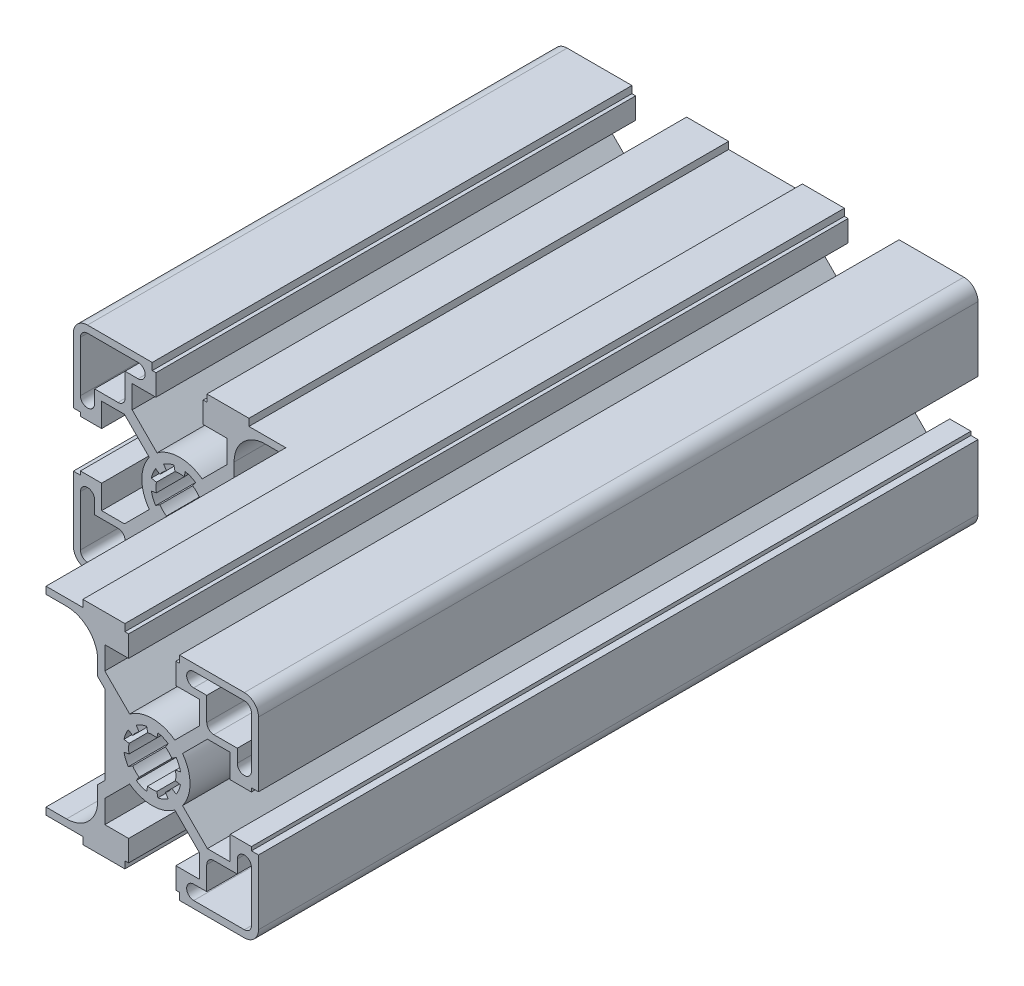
from build123d import *

# Parameters (mm, degrees)
BOSS_EXTRUDE1_DEPTH = 76.2
SKETCH2_W           = 45.0088
SKETCH2_H           = 45.0088
CUT_EXTRUDE1_DEPTH  = 50.8


with BuildPart() as part:
    # Sketch1 → Boss-Extrude1 (new, symmetric)
    with BuildSketch(Plane.XY):
        with BuildLine():
            Line((-42.0116, 22.5044), (-28.2956, 22.5044))
            Line((-28.2956, 22.5044), (-28.2956, 21.0058))
            Line((-28.2956, 21.0058), (-27.5082, 21.0058))
            Line((-27.5082, 21.0058), (-27.5082, 16.51))
            Line((-27.5082, 16.51), (-32.5501, 16.51))
            Line((-32.5501, 16.51), (-32.5501, 11.680106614))
            Line((-32.5501, 11.680106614), (-27.285426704, 6.415433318))
            ThreePointArc((-27.285426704, 6.415433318), (-22.5044, 8.001), (-17.723373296, 6.415433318))
            Line((-17.723373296, 6.415433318), (-12.4587, 11.680106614))
            Line((-12.4587, 11.680106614), (-12.4587, 16.51))
            Line((-12.4587, 16.51), (-17.5006, 16.51))
            Line((-17.5006, 16.51), (-17.5006, 21.0058))
            Line((-17.5006, 21.0058), (-16.7132, 21.0058))
            Line((-16.7132, 21.0058), (-16.7132, 22.5044))
            Line((-16.7132, 22.5044), (-7.8105, 22.5044))
            Line((-7.8105, 22.5044), (-7.8105, 21.0058))
            Line((-7.8105, 21.0058), (7.8105, 21.0058))
            Line((7.8105, 21.0058), (7.8105, 22.5044))
            Line((7.8105, 22.5044), (16.7132, 22.5044))
            Line((16.7132, 22.5044), (16.7132, 21.0058))
            Line((16.7132, 21.0058), (17.5006, 21.0058))
            Line((17.5006, 21.0058), (17.5006, 16.51))
            Line((17.5006, 16.51), (12.4587, 16.51))
            Line((12.4587, 16.51), (12.4587, 11.680106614))
            Line((12.4587, 11.680106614), (17.723373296, 6.415433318))
            ThreePointArc((17.723373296, 6.415433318), (22.5044, 8.001), (27.285426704, 6.415433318))
            Line((27.285426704, 6.415433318), (32.5501, 11.680106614))
            Line((32.5501, 11.680106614), (32.5501, 16.51))
            Line((32.5501, 16.51), (27.5082, 16.51))
            Line((27.5082, 16.51), (27.5082, 21.0058))
            Line((27.5082, 21.0058), (28.2956, 21.0058))
            Line((28.2956, 21.0058), (28.2956, 22.5044))
            Line((28.2956, 22.5044), (42.0116, 22.5044))
            ThreePointArc((42.0116, 22.5044), (44.130940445, 21.626540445), (45.0088, 19.5072))
            Line((45.0088, 19.5072), (45.0088, 5.7912))
            Line((45.0088, 5.7912), (43.5102, 5.7912))
            Line((43.5102, 5.7912), (43.5102, 5.0038))
            Line((43.5102, 5.0038), (39.0144, 5.0038))
            Line((39.0144, 5.0038), (39.0144, 10.0457))
            Line((39.0144, 10.0457), (34.184506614, 10.0457))
            Line((34.184506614, 10.0457), (28.919833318, 4.781026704))
            ThreePointArc((28.919833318, 4.781026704), (30.5054, 0), (28.919833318, -4.781026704))
            Line((28.919833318, -4.781026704), (34.184506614, -10.0457))
            Line((34.184506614, -10.0457), (39.0144, -10.0457))
            Line((39.0144, -10.0457), (39.0144, -5.0038))
            Line((39.0144, -5.0038), (43.5102, -5.0038))
            Line((43.5102, -5.0038), (43.5102, -5.7912))
            Line((43.5102, -5.7912), (45.0088, -5.7912))
            Line((45.0088, -5.7912), (45.0088, -19.5072))
            ThreePointArc((45.0088, -19.5072), (44.130940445, -21.626540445), (42.0116, -22.5044))
            Line((42.0116, -22.5044), (28.2956, -22.5044))
            Line((28.2956, -22.5044), (28.2956, -21.0058))
            Line((28.2956, -21.0058), (27.5082, -21.0058))
            Line((27.5082, -21.0058), (27.5082, -16.51))
            Line((27.5082, -16.51), (32.5501, -16.51))
            Line((32.5501, -16.51), (32.5501, -11.680106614))
            Line((32.5501, -11.680106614), (27.285426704, -6.415433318))
            ThreePointArc((27.285426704, -6.415433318), (22.5044, -8.001), (17.723373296, -6.415433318))
            Line((17.723373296, -6.415433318), (12.4587, -11.680106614))
            Line((12.4587, -11.680106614), (12.4587, -16.51))
            Line((12.4587, -16.51), (17.5006, -16.51))
            Line((17.5006, -16.51), (17.5006, -21.0058))
            Line((17.5006, -21.0058), (16.7132, -21.0058))
            Line((16.7132, -21.0058), (16.7132, -22.5044))
            Line((16.7132, -22.5044), (7.8105, -22.5044))
            Line((7.8105, -22.5044), (7.8105, -21.0058))
            Line((7.8105, -21.0058), (-7.8105, -21.0058))
            Line((-7.8105, -21.0058), (-7.8105, -22.5044))
            Line((-7.8105, -22.5044), (-16.7132, -22.5044))
            Line((-16.7132, -22.5044), (-16.7132, -21.0058))
            Line((-16.7132, -21.0058), (-17.5006, -21.0058))
            Line((-17.5006, -21.0058), (-17.5006, -16.51))
            Line((-17.5006, -16.51), (-12.4587, -16.51))
            Line((-12.4587, -16.51), (-12.4587, -11.680106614))
            Line((-12.4587, -11.680106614), (-17.723373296, -6.415433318))
            ThreePointArc((-17.723373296, -6.415433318), (-22.5044, -8.001), (-27.285426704, -6.415433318))
            Line((-27.285426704, -6.415433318), (-32.5501, -11.680106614))
            Line((-32.5501, -11.680106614), (-32.5501, -16.51))
            Line((-32.5501, -16.51), (-27.5082, -16.51))
            Line((-27.5082, -16.51), (-27.5082, -21.0058))
            Line((-27.5082, -21.0058), (-28.2956, -21.0058))
            Line((-28.2956, -21.0058), (-28.2956, -22.5044))
            Line((-28.2956, -22.5044), (-42.0116, -22.5044))
            ThreePointArc((-42.0116, -22.5044), (-44.130940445, -21.626540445), (-45.0088, -19.5072))
            Line((-45.0088, -19.5072), (-45.0088, -5.7912))
            Line((-45.0088, -5.7912), (-43.5102, -5.7912))
            Line((-43.5102, -5.7912), (-43.5102, -5.0038))
            Line((-43.5102, -5.0038), (-39.0144, -5.0038))
            Line((-39.0144, -5.0038), (-39.0144, -10.0457))
            Line((-39.0144, -10.0457), (-34.184506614, -10.0457))
            Line((-34.184506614, -10.0457), (-28.919833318, -4.781026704))
            ThreePointArc((-28.919833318, -4.781026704), (-30.5054, 0), (-28.919833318, 4.781026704))
            Line((-28.919833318, 4.781026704), (-34.184506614, 10.0457))
            Line((-34.184506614, 10.0457), (-39.0144, 10.0457))
            Line((-39.0144, 10.0457), (-39.0144, 5.0038))
            Line((-39.0144, 5.0038), (-43.5102, 5.0038))
            Line((-43.5102, 5.0038), (-43.5102, 5.7912))
            Line((-43.5102, 5.7912), (-45.0088, 5.7912))
            Line((-45.0088, 5.7912), (-45.0088, 19.5072))
            ThreePointArc((-45.0088, 19.5072), (-44.130940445, 21.626540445), (-42.0116, 22.5044))
        make_face()
        with BuildLine():
            Line((-40.513, 11.5443), (-35.5473, 11.5443))
            ThreePointArc((-35.5473, 11.5443), (-34.487629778, 11.983229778), (-34.0487, 13.0429))
            Line((-34.0487, 13.0429), (-34.0487, 18.0086))
            Line((-34.0487, 18.0086), (-31.2928, 18.0086))
            ThreePointArc((-31.2928, 18.0086), (-29.7942, 19.5072), (-31.2928, 21.0058))
            Line((-31.2928, 21.0058), (-42.0116, 21.0058))
            ThreePointArc((-42.0116, 21.0058), (-43.071270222, 20.566870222), (-43.5102, 19.5072))
            Line((-43.5102, 19.5072), (-43.5102, 8.7884))
            ThreePointArc((-43.5102, 8.7884), (-42.0116, 7.2898), (-40.513, 8.7884))
            Line((-40.513, 8.7884), (-40.513, 11.5443))
        make_face(mode=Mode.SUBTRACT)
        with BuildLine():
            Line((-21.315129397, 5.978867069), (-21.528207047, 4.907653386))
            ThreePointArc((-21.528207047, 4.907653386), (-22.5044, 5.0038), (-23.480592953, 4.907653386))
            Line((-23.480592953, 4.907653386), (-23.693670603, 5.978867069))
            ThreePointArc((-23.693670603, 5.978867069), (-24.837238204, 5.63196963), (-25.89115614, 5.068638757))
            Line((-25.89115614, 5.068638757), (-25.284362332, 4.160507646))
            ThreePointArc((-25.284362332, 4.160507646), (-26.042620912, 3.538220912), (-26.664907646, 2.779962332))
            Line((-26.664907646, 2.779962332), (-27.573038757, 3.38675614))
            ThreePointArc((-27.573038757, 3.38675614), (-28.13636963, 2.332838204), (-28.483267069, 1.189270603))
            Line((-28.483267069, 1.189270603), (-27.412053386, 0.976192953))
            ThreePointArc((-27.412053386, 0.976192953), (-27.5082, 0), (-27.412053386, -0.976192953))
            Line((-27.412053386, -0.976192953), (-28.483267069, -1.189270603))
            ThreePointArc((-28.483267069, -1.189270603), (-28.13636963, -2.332838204), (-27.573038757, -3.38675614))
            Line((-27.573038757, -3.38675614), (-26.664907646, -2.779962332))
            ThreePointArc((-26.664907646, -2.779962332), (-26.042620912, -3.538220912), (-25.284362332, -4.160507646))
            Line((-25.284362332, -4.160507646), (-25.89115614, -5.068638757))
            ThreePointArc((-25.89115614, -5.068638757), (-24.837238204, -5.63196963), (-23.693670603, -5.978867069))
            Line((-23.693670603, -5.978867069), (-23.480592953, -4.907653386))
            ThreePointArc((-23.480592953, -4.907653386), (-22.5044, -5.0038), (-21.528207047, -4.907653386))
            Line((-21.528207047, -4.907653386), (-21.315129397, -5.978867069))
            ThreePointArc((-21.315129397, -5.978867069), (-20.171561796, -5.63196963), (-19.11764386, -5.068638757))
            Line((-19.11764386, -5.068638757), (-19.724437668, -4.160507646))
            ThreePointArc((-19.724437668, -4.160507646), (-18.966179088, -3.538220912), (-18.343892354, -2.779962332))
            Line((-18.343892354, -2.779962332), (-17.435761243, -3.38675614))
            ThreePointArc((-17.435761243, -3.38675614), (-16.87243037, -2.332838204), (-16.525532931, -1.189270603))
            Line((-16.525532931, -1.189270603), (-17.596746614, -0.976192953))
            ThreePointArc((-17.596746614, -0.976192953), (-17.5006, 0), (-17.596746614, 0.976192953))
            Line((-17.596746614, 0.976192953), (-16.525532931, 1.189270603))
            ThreePointArc((-16.525532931, 1.189270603), (-16.87243037, 2.332838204), (-17.435761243, 3.38675614))
            Line((-17.435761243, 3.38675614), (-18.343892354, 2.779962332))
            ThreePointArc((-18.343892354, 2.779962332), (-18.966179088, 3.538220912), (-19.724437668, 4.160507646))
            Line((-19.724437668, 4.160507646), (-19.11764386, 5.068638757))
            ThreePointArc((-19.11764386, 5.068638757), (-20.171561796, 5.63196963), (-21.315129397, 5.978867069))
        make_face(mode=Mode.SUBTRACT)
        with BuildLine():
            Line((-10.9601, 9.909893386), (-12.4587, 8.411293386))
            Line((-12.4587, 8.411293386), (-12.4587, -8.411293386))
            Line((-12.4587, -8.411293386), (-10.9601, -9.909893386))
            Line((-10.9601, -9.909893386), (-10.9601, -12.9032))
            ThreePointArc((-10.9601, -12.9032), (-9.025833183, -17.572933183), (-4.3561, -19.5072))
            Line((-4.3561, -19.5072), (4.3561, -19.5072))
            ThreePointArc((4.3561, -19.5072), (9.025833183, -17.572933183), (10.9601, -12.9032))
            Line((10.9601, -12.9032), (10.9601, -9.909893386))
            Line((10.9601, -9.909893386), (12.4587, -8.411293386))
            Line((12.4587, -8.411293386), (12.4587, 8.411293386))
            Line((12.4587, 8.411293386), (10.9601, 9.909893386))
            Line((10.9601, 9.909893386), (10.9601, 12.9032))
            ThreePointArc((10.9601, 12.9032), (9.025833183, 17.572933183), (4.3561, 19.5072))
            Line((4.3561, 19.5072), (-4.3561, 19.5072))
            ThreePointArc((-4.3561, 19.5072), (-9.025833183, 17.572933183), (-10.9601, 12.9032))
            Line((-10.9601, 12.9032), (-10.9601, 9.909893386))
        make_face(mode=Mode.SUBTRACT)
        with BuildLine():
            Line((-40.513, -11.5443), (-35.5473, -11.5443))
            ThreePointArc((-35.5473, -11.5443), (-34.487629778, -11.983229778), (-34.0487, -13.0429))
            Line((-34.0487, -13.0429), (-34.0487, -18.0086))
            Line((-34.0487, -18.0086), (-31.2928, -18.0086))
            ThreePointArc((-31.2928, -18.0086), (-29.7942, -19.5072), (-31.2928, -21.0058))
            Line((-31.2928, -21.0058), (-42.0116, -21.0058))
            ThreePointArc((-42.0116, -21.0058), (-43.071270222, -20.566870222), (-43.5102, -19.5072))
            Line((-43.5102, -19.5072), (-43.5102, -8.7884))
            ThreePointArc((-43.5102, -8.7884), (-42.0116, -7.2898), (-40.513, -8.7884))
            Line((-40.513, -8.7884), (-40.513, -11.5443))
        make_face(mode=Mode.SUBTRACT)
        with BuildLine():
            Line((42.0116, 21.0058), (31.2928, 21.0058))
            ThreePointArc((31.2928, 21.0058), (29.7942, 19.5072), (31.2928, 18.0086))
            Line((31.2928, 18.0086), (34.0487, 18.0086))
            Line((34.0487, 18.0086), (34.0487, 13.0429))
            ThreePointArc((34.0487, 13.0429), (34.487629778, 11.983229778), (35.5473, 11.5443))
            Line((35.5473, 11.5443), (40.513, 11.5443))
            Line((40.513, 11.5443), (40.513, 8.7884))
            ThreePointArc((40.513, 8.7884), (42.0116, 7.2898), (43.5102, 8.7884))
            Line((43.5102, 8.7884), (43.5102, 19.5072))
            ThreePointArc((43.5102, 19.5072), (43.071270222, 20.566870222), (42.0116, 21.0058))
        make_face(mode=Mode.SUBTRACT)
        with BuildLine():
            Line((40.513, -11.5443), (35.5473, -11.5443))
            ThreePointArc((35.5473, -11.5443), (34.487629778, -11.983229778), (34.0487, -13.0429))
            Line((34.0487, -13.0429), (34.0487, -18.0086))
            Line((34.0487, -18.0086), (31.2928, -18.0086))
            ThreePointArc((31.2928, -18.0086), (29.7942, -19.5072), (31.2928, -21.0058))
            Line((31.2928, -21.0058), (42.0116, -21.0058))
            ThreePointArc((42.0116, -21.0058), (43.071270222, -20.566870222), (43.5102, -19.5072))
            Line((43.5102, -19.5072), (43.5102, -8.7884))
            ThreePointArc((43.5102, -8.7884), (42.0116, -7.2898), (40.513, -8.7884))
            Line((40.513, -8.7884), (40.513, -11.5443))
        make_face(mode=Mode.SUBTRACT)
        with BuildLine():
            Line((27.573038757, 3.38675614), (26.664907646, 2.779962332))
            ThreePointArc((26.664907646, 2.779962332), (26.042620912, 3.538220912), (25.284362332, 4.160507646))
            Line((25.284362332, 4.160507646), (25.89115614, 5.068638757))
            ThreePointArc((25.89115614, 5.068638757), (24.837238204, 5.63196963), (23.693670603, 5.978867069))
            Line((23.693670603, 5.978867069), (23.480592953, 4.907653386))
            ThreePointArc((23.480592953, 4.907653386), (22.5044, 5.0038), (21.528207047, 4.907653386))
            Line((21.528207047, 4.907653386), (21.315129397, 5.978867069))
            ThreePointArc((21.315129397, 5.978867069), (20.171561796, 5.63196963), (19.11764386, 5.068638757))
            Line((19.11764386, 5.068638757), (19.724437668, 4.160507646))
            ThreePointArc((19.724437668, 4.160507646), (18.966179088, 3.538220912), (18.343892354, 2.779962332))
            Line((18.343892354, 2.779962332), (17.435761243, 3.38675614))
            ThreePointArc((17.435761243, 3.38675614), (16.87243037, 2.332838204), (16.525532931, 1.189270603))
            Line((16.525532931, 1.189270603), (17.596746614, 0.976192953))
            ThreePointArc((17.596746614, 0.976192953), (17.5006, 0), (17.596746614, -0.976192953))
            Line((17.596746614, -0.976192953), (16.525532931, -1.189270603))
            ThreePointArc((16.525532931, -1.189270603), (16.87243037, -2.332838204), (17.435761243, -3.38675614))
            Line((17.435761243, -3.38675614), (18.343892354, -2.779962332))
            ThreePointArc((18.343892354, -2.779962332), (18.966179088, -3.538220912), (19.724437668, -4.160507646))
            Line((19.724437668, -4.160507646), (19.11764386, -5.068638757))
            ThreePointArc((19.11764386, -5.068638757), (20.171561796, -5.63196963), (21.315129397, -5.978867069))
            Line((21.315129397, -5.978867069), (21.528207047, -4.907653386))
            ThreePointArc((21.528207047, -4.907653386), (22.5044, -5.0038), (23.480592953, -4.907653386))
            Line((23.480592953, -4.907653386), (23.693670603, -5.978867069))
            ThreePointArc((23.693670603, -5.978867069), (24.837238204, -5.63196963), (25.89115614, -5.068638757))
            Line((25.89115614, -5.068638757), (25.284362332, -4.160507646))
            ThreePointArc((25.284362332, -4.160507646), (26.042620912, -3.538220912), (26.664907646, -2.779962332))
            Line((26.664907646, -2.779962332), (27.573038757, -3.38675614))
            ThreePointArc((27.573038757, -3.38675614), (28.13636963, -2.332838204), (28.483267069, -1.189270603))
            Line((28.483267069, -1.189270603), (27.412053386, -0.976192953))
            ThreePointArc((27.412053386, -0.976192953), (27.5082, 0), (27.412053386, 0.976192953))
            Line((27.412053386, 0.976192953), (28.483267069, 1.189270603))
            ThreePointArc((28.483267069, 1.189270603), (28.13636963, 2.332838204), (27.573038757, 3.38675614))
        make_face(mode=Mode.SUBTRACT)
    extrude(amount=BOSS_EXTRUDE1_DEPTH, both=True)

    # Sketch2 → Cut-Extrude1 (cut)
    with BuildSketch(Plane.XY.offset(76.2)):
        with Locations((-22.5044, 0)):
            Rectangle(SKETCH2_W, SKETCH2_H)
    extrude(amount=-CUT_EXTRUDE1_DEPTH, mode=Mode.SUBTRACT)


solid = part.part
